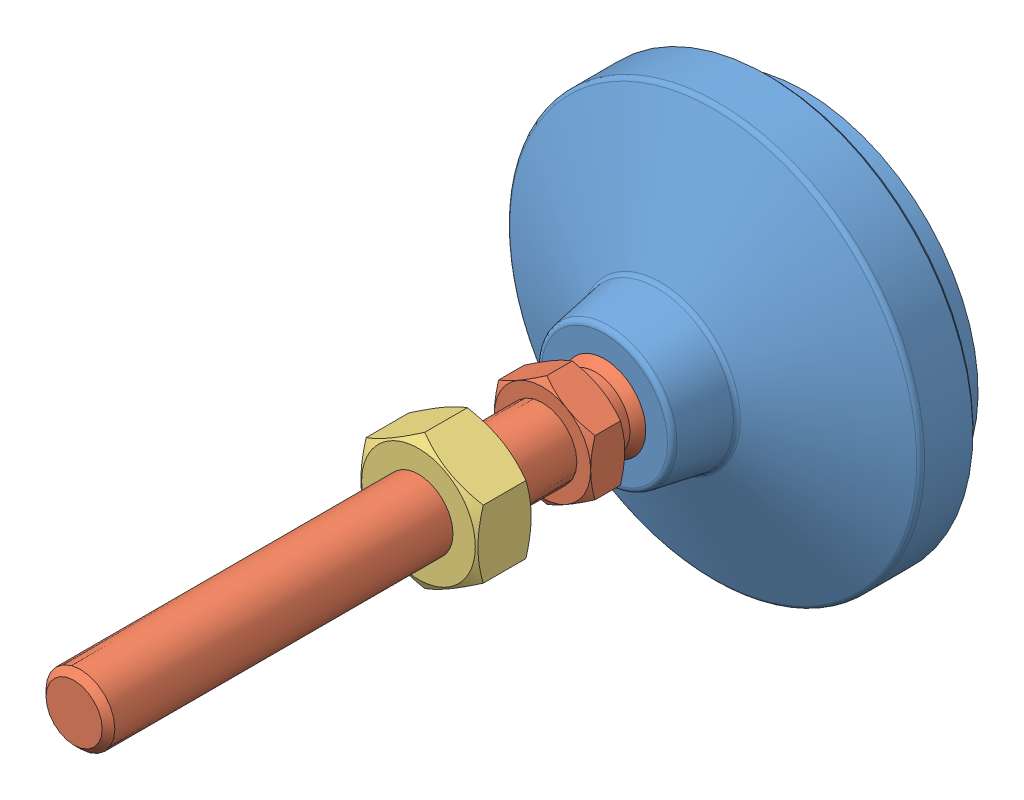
SolidWorks assembly LSVA50-M10X68-SUS.sldasm, configuration Default (file format 15000). Lengths in mm.
Overall size (60 60 106).
3 component instances, 3 part files, 0 mates.
Components (placement in the parent):
- LSVA50-M10X68-SUS_01-1: LSVA50-M10X68-SUS_01.sldprt [Default] at (0 0 5) x (1 0 0) z (0 -1 0) size (60 29 60)
- LSVA50-M10X68-SUS_02-1: LSVA50-M10X68-SUS_02.sldprt [Default] at (0 0 25.4) x (1 0 0) z (0 -1 0) size (14 87.6 16.17)
- LSVA50-M10X68-SUS_03-1: LSVA50-M10X68-SUS_03.sldprt [Default] at (0 0 48) size (17 19.63 8)
